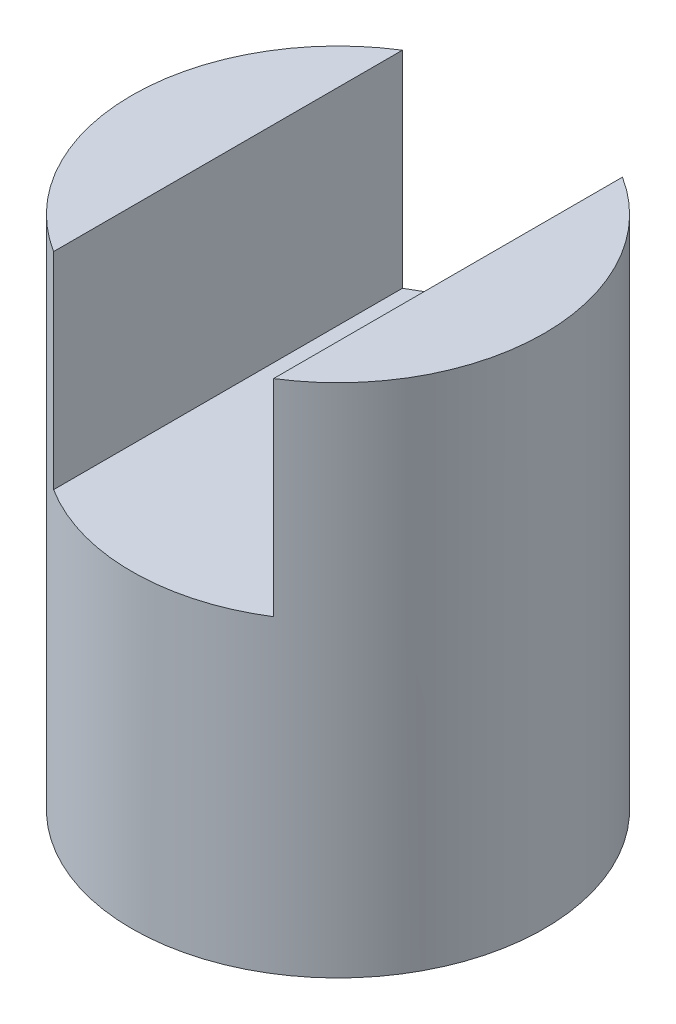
ISO-10303-21;
HEADER;
FILE_DESCRIPTION(('STEP AP214'),'2;1');
FILE_NAME('part.step','',(''),(''),'','','');
FILE_SCHEMA(('AUTOMOTIVE_DESIGN { 1 0 10303 214 1 1 1 1 }'));
ENDSEC;
DATA;
#1=APPLICATION_CONTEXT('core data for automotive mechanical design processes');
#2=APPLICATION_PROTOCOL_DEFINITION('international standard','automotive_design',2000,#1);
#3=PRODUCT_CONTEXT('',#1,'mechanical');
#4=PRODUCT('Part','Part','',(#3));
#5=PRODUCT_RELATED_PRODUCT_CATEGORY('part','',(#4));
#6=PRODUCT_DEFINITION_FORMATION('','',#4);
#7=PRODUCT_DEFINITION_CONTEXT('part definition',#1,'design');
#8=PRODUCT_DEFINITION('design','',#6,#7);
#9=PRODUCT_DEFINITION_SHAPE('','',#8);
#10=(LENGTH_UNIT() NAMED_UNIT(*) SI_UNIT(.MILLI.,.METRE.));
#11=(NAMED_UNIT(*) PLANE_ANGLE_UNIT() SI_UNIT($,.RADIAN.));
#12=(NAMED_UNIT(*) SI_UNIT($,.STERADIAN.) SOLID_ANGLE_UNIT());
#13=UNCERTAINTY_MEASURE_WITH_UNIT(LENGTH_MEASURE(1.E-05),#10,'distance_accuracy_value','');
#14=(GEOMETRIC_REPRESENTATION_CONTEXT(3) GLOBAL_UNCERTAINTY_ASSIGNED_CONTEXT((#13)) GLOBAL_UNIT_ASSIGNED_CONTEXT((#10,
#11,#12)) REPRESENTATION_CONTEXT('',''));
#15=CARTESIAN_POINT('',(0.,0.,0.));
#16=DIRECTION('',(0.,0.,1.));
#17=DIRECTION('',(1.,0.,0.));
#18=AXIS2_PLACEMENT_3D('',#15,#16,#17);
#19=CARTESIAN_POINT('',(0.,75.,0.));
#20=DIRECTION('',(0.,1.,0.));
#21=DIRECTION('',(0.,0.,1.));
#22=AXIS2_PLACEMENT_3D('',#19,#20,#21);
#23=PLANE('',#22);
#24=DIRECTION('',(0.,0.,1.));
#25=VECTOR('',#24,1.);
#26=CARTESIAN_POINT('',(-16.,75.,0.));
#27=LINE('',#26,#25);
#28=CARTESIAN_POINT('',(-16.,75.,-25.377155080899));
#29=VERTEX_POINT('',#28);
#30=CARTESIAN_POINT('',(-16.,75.,25.377155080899));
#31=VERTEX_POINT('',#30);
#32=EDGE_CURVE('E78',#29,#31,#27,.T.);
#33=ORIENTED_EDGE('',*,*,#32,.F.);
#34=CARTESIAN_POINT('',(0.,75.,0.));
#35=DIRECTION('',(0.,1.,0.));
#36=DIRECTION('',(0.,0.,1.));
#37=AXIS2_PLACEMENT_3D('',#34,#35,#36);
#38=CIRCLE('',#37,30.);
#39=EDGE_CURVE('E89',#29,#31,#38,.T.);
#40=ORIENTED_EDGE('',*,*,#39,.T.);
#41=EDGE_LOOP('',(#33,#40));
#42=FACE_BOUND('',#41,.T.);
#43=ADVANCED_FACE('F31',(#42),#23,.T.);
#44=CARTESIAN_POINT('',(0.,75.,0.));
#45=DIRECTION('',(0.,-1.,0.));
#46=DIRECTION('',(0.,0.,-1.));
#47=AXIS2_PLACEMENT_3D('',#44,#45,#46);
#48=CYLINDRICAL_SURFACE('',#47,30.);
#49=ORIENTED_EDGE('',*,*,#39,.F.);
#50=DIRECTION('',(0.,-1.,0.));
#51=VECTOR('',#50,1.);
#52=CARTESIAN_POINT('',(-16.,75.,-25.377155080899));
#53=LINE('',#52,#51);
#54=CARTESIAN_POINT('',(-16.,45.,-25.377155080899));
#55=VERTEX_POINT('',#54);
#56=EDGE_CURVE('E95',#29,#55,#53,.T.);
#57=ORIENTED_EDGE('',*,*,#56,.T.);
#58=CARTESIAN_POINT('',(0.,45.,0.));
#59=DIRECTION('',(0.,1.,0.));
#60=DIRECTION('',(0.,0.,1.));
#61=AXIS2_PLACEMENT_3D('',#58,#59,#60);
#62=CIRCLE('',#61,30.);
#63=CARTESIAN_POINT('',(16.,45.,-25.377155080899));
#64=VERTEX_POINT('',#63);
#65=EDGE_CURVE('E11',#64,#55,#62,.T.);
#66=ORIENTED_EDGE('',*,*,#65,.F.);
#67=DIRECTION('',(0.,-1.,0.));
#68=VECTOR('',#67,1.);
#69=CARTESIAN_POINT('',(16.,75.,-25.377155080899));
#70=LINE('',#69,#68);
#71=CARTESIAN_POINT('',(16.,75.,-25.377155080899));
#72=VERTEX_POINT('',#71);
#73=EDGE_CURVE('E73',#64,#72,#70,.F.);
#74=ORIENTED_EDGE('',*,*,#73,.T.);
#75=CARTESIAN_POINT('',(16.,75.,25.377155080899));
#76=VERTEX_POINT('',#75);
#77=EDGE_CURVE('E79',#76,#72,#38,.T.);
#78=ORIENTED_EDGE('',*,*,#77,.F.);
#79=DIRECTION('',(0.,-1.,0.));
#80=VECTOR('',#79,1.);
#81=CARTESIAN_POINT('',(16.,75.,25.377155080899));
#82=LINE('',#81,#80);
#83=CARTESIAN_POINT('',(16.,45.,25.377155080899));
#84=VERTEX_POINT('',#83);
#85=EDGE_CURVE('E46',#76,#84,#82,.T.);
#86=ORIENTED_EDGE('',*,*,#85,.T.);
#87=CARTESIAN_POINT('',(-16.,45.,25.377155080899));
#88=VERTEX_POINT('',#87);
#89=EDGE_CURVE('E35',#88,#84,#62,.T.);
#90=ORIENTED_EDGE('',*,*,#89,.F.);
#91=DIRECTION('',(0.,-1.,0.));
#92=VECTOR('',#91,1.);
#93=CARTESIAN_POINT('',(-16.,75.,25.377155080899));
#94=LINE('',#93,#92);
#95=EDGE_CURVE('E54',#88,#31,#94,.F.);
#96=ORIENTED_EDGE('',*,*,#95,.T.);
#97=EDGE_LOOP('',(#49,#57,#66,#74,#78,#86,#90,#96));
#98=FACE_BOUND('',#97,.T.);
#99=CARTESIAN_POINT('',(0.,0.,0.));
#100=DIRECTION('',(0.,1.,0.));
#101=DIRECTION('',(0.,0.,1.));
#102=AXIS2_PLACEMENT_3D('',#99,#100,#101);
#103=CIRCLE('',#102,30.);
#104=CARTESIAN_POINT('',(0.,0.,30.));
#105=VERTEX_POINT('',#104);
#106=EDGE_CURVE('E92',#105,#105,#103,.T.);
#107=ORIENTED_EDGE('',*,*,#106,.T.);
#108=EDGE_LOOP('',(#107));
#109=FACE_BOUND('',#108,.T.);
#110=ADVANCED_FACE('F33',(#98,#109),#48,.T.);
#111=DIRECTION('',(0.,0.,-1.));
#112=VECTOR('',#111,1.);
#113=CARTESIAN_POINT('',(16.,75.,0.));
#114=LINE('',#113,#112);
#115=EDGE_CURVE('E70',#76,#72,#114,.T.);
#116=ORIENTED_EDGE('',*,*,#115,.F.);
#117=ORIENTED_EDGE('',*,*,#77,.T.);
#118=EDGE_LOOP('',(#116,#117));
#119=FACE_BOUND('',#118,.T.);
#120=ADVANCED_FACE('F88',(#119),#23,.T.);
#121=CARTESIAN_POINT('',(0.,0.,0.));
#122=DIRECTION('',(0.,1.,0.));
#123=DIRECTION('',(0.,0.,1.));
#124=AXIS2_PLACEMENT_3D('',#121,#122,#123);
#125=PLANE('',#124);
#126=ORIENTED_EDGE('',*,*,#106,.F.);
#127=EDGE_LOOP('',(#126));
#128=FACE_BOUND('',#127,.T.);
#129=ADVANCED_FACE('F115',(#128),#125,.F.);
#130=CARTESIAN_POINT('',(-16.,45.,52.1788235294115));
#131=DIRECTION('',(0.,1.,0.));
#132=DIRECTION('',(0.,0.,1.));
#133=AXIS2_PLACEMENT_3D('',#130,#131,#132);
#134=PLANE('',#133);
#135=ORIENTED_EDGE('',*,*,#65,.T.);
#136=DIRECTION('',(0.,0.,1.));
#137=VECTOR('',#136,1.);
#138=CARTESIAN_POINT('',(-16.,45.,-47.2950912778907));
#139=LINE('',#138,#137);
#140=EDGE_CURVE('E102',#55,#88,#139,.T.);
#141=ORIENTED_EDGE('',*,*,#140,.T.);
#142=ORIENTED_EDGE('',*,*,#89,.T.);
#143=DIRECTION('',(0.,0.,-1.));
#144=VECTOR('',#143,1.);
#145=CARTESIAN_POINT('',(16.,45.,-47.2950912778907));
#146=LINE('',#145,#144);
#147=EDGE_CURVE('E86',#84,#64,#146,.T.);
#148=ORIENTED_EDGE('',*,*,#147,.T.);
#149=EDGE_LOOP('',(#135,#141,#142,#148));
#150=FACE_BOUND('',#149,.T.);
#151=ADVANCED_FACE('F101',(#150),#134,.T.);
#152=CARTESIAN_POINT('',(-16.,45.,-47.2950912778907));
#153=DIRECTION('',(-1.,0.,0.));
#154=DIRECTION('',(0.,0.,1.));
#155=AXIS2_PLACEMENT_3D('',#152,#153,#154);
#156=PLANE('',#155);
#157=ORIENTED_EDGE('',*,*,#32,.T.);
#158=ORIENTED_EDGE('',*,*,#95,.F.);
#159=ORIENTED_EDGE('',*,*,#140,.F.);
#160=ORIENTED_EDGE('',*,*,#56,.F.);
#161=EDGE_LOOP('',(#157,#158,#159,#160));
#162=FACE_BOUND('',#161,.T.);
#163=ADVANCED_FACE('F106',(#162),#156,.F.);
#164=CARTESIAN_POINT('',(16.,45.,-47.2950912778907));
#165=DIRECTION('',(1.,0.,0.));
#166=DIRECTION('',(0.,0.,-1.));
#167=AXIS2_PLACEMENT_3D('',#164,#165,#166);
#168=PLANE('',#167);
#169=ORIENTED_EDGE('',*,*,#115,.T.);
#170=ORIENTED_EDGE('',*,*,#73,.F.);
#171=ORIENTED_EDGE('',*,*,#147,.F.);
#172=ORIENTED_EDGE('',*,*,#85,.F.);
#173=EDGE_LOOP('',(#169,#170,#171,#172));
#174=FACE_BOUND('',#173,.T.);
#175=ADVANCED_FACE('F72',(#174),#168,.F.);
#176=CLOSED_SHELL('',(#43,#110,#120,#129,#151,#163,#175));
#177=MANIFOLD_SOLID_BREP('B2',#176);
#178=ADVANCED_BREP_SHAPE_REPRESENTATION('',(#18,#177),#14);
#179=SHAPE_DEFINITION_REPRESENTATION(#9,#178);
ENDSEC;
END-ISO-10303-21;
